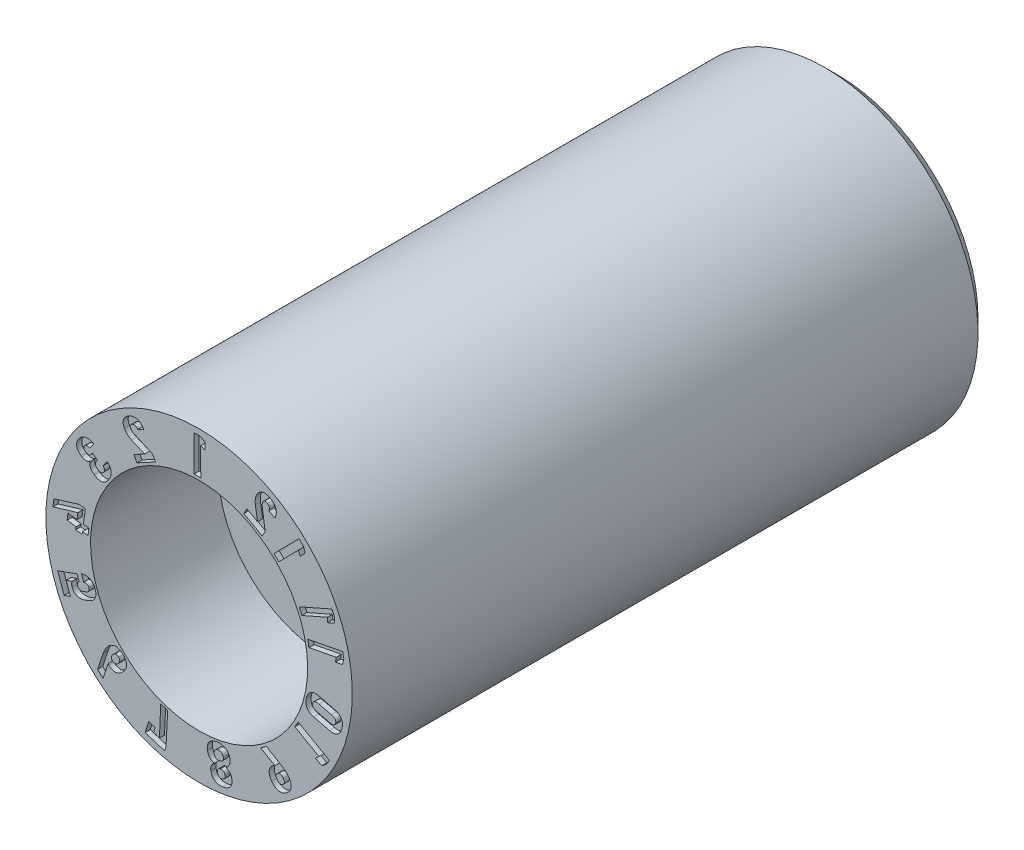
from build123d import *

# Parameters (mm, degrees)
CUT_EXTRUDE1_DEPTH = 0.2


with BuildPart() as part:
    # Sketch1 → Revolve1 (revolve)
    with BuildSketch(Plane(origin=(0, 0, 0), x_dir=(0, 0, -1), z_dir=(1, 0, 0)), mode=Mode.PRIVATE) as revolve1_sk:
        Polygon((25, 3), (25, 5.5), (24.5, 6), (0, 6), (0, 4.25), (5, 4.25), (5, 1.5), (18, 1.5), (18, 3), align=None)
    revolve(revolve1_sk.sketch.rotate(Axis((0, 0, 0), (0, 0, -1)), 180), axis=Axis((0, 0, 0), (0, 0, -1)))

    # Sketch2 → Cut-Extrude1 (cut)
    # profile 1 of 15: a face of its own
    with BuildSketch(Plane.XY):
        Polygon((-0.197789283, 4.361647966), (0.066563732, 4.363172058), (0.060734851, 5.45638428), (0.232188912, 5.392327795), (0.230736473, 5.673574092), (0.020579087, 5.766859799), (-0.20515278, 5.765581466), align=None)
    # profile 2 of 15: a face of its own
    with BuildSketch(Plane.XY):
        with BuildLine():
            Line((-1.818293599, 4.226114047), (-2.540496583, 4.55327584))
            add(Edge.make_bspline(
                [(-2.540496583, 4.55327584), (-2.570849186, 4.567228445), (-2.607531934, 4.587861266), (-2.643392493, 4.620897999), (-2.66313812, 4.641625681), (-2.675061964, 4.658815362), (-2.681524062, 4.670623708)],
                knots=[0, 0, 0, 0, 0.540031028, 0.66553244, 0.783527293, 1, 1, 1, 1], degree=3))
            Line((-2.681524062, 4.670623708), (-2.682483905, 4.672279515))
            add(Edge.make_bspline(
                [(-2.682483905, 4.672279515), (-2.691000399, 4.687155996), (-2.699210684, 4.711252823), (-2.698842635, 4.744176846), (-2.692586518, 4.767175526), (-2.680864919, 4.788954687), (-2.657016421, 4.817386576), (-2.632502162, 4.833373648), (-2.614935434, 4.842989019)],
                knots=[0, 0, 0, 0, 0.246786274, 0.356909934, 0.46944845, 0.586307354, 0.710253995, 1, 1, 1, 1], degree=3))
            add(Edge.make_bspline(
                [(-2.614935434, 4.842989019), (-2.597313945, 4.85241795), (-2.568802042, 4.862517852), (-2.529364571, 4.862700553), (-2.500878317, 4.856309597), (-2.47339714, 4.843926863), (-2.436703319, 4.81861036), (-2.414141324, 4.791924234), (-2.400526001, 4.772308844)],
                knots=[0, 0, 0, 0, 0.240300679, 0.353786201, 0.468512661, 0.587496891, 0.71289196, 1, 1, 1, 1], degree=3))
            Line((-2.400526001, 4.772308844), (-2.400124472, 4.771361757))
            Line((-2.400124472, 4.771361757), (-2.162339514, 4.899762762))
            Line((-2.162339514, 4.899762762), (-2.162741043, 4.900709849))
            add(Edge.make_bspline(
                [(-2.162741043, 4.900709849), (-2.184602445, 4.935428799), (-2.221196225, 4.983520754), (-2.278910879, 5.036863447), (-2.323937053, 5.068901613), (-2.371113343, 5.094233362), (-2.420103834, 5.112587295), (-2.470846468, 5.122937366), (-2.522762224, 5.126556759), (-2.575604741, 5.122918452), (-2.647953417, 5.107258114), (-2.700403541, 5.085897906), (-2.733995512, 5.067458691)],
                knots=[0, 0, 0, 0, 0.185247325, 0.270908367, 0.35379884, 0.433963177, 0.511943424, 0.589014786, 0.666847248, 0.746166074, 0.827198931, 1, 1, 1, 1], degree=3))
            add(Edge.make_bspline(
                [(-2.733995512, 5.067458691), (-2.769634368, 5.048059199), (-2.819604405, 5.015973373), (-2.876537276, 4.964598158), (-2.910766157, 4.924674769), (-2.938201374, 4.882841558), (-2.958403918, 4.839047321), (-2.971663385, 4.793560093), (-2.976863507, 4.746392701), (-2.975338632, 4.698075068), (-2.962100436, 4.630645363), (-2.941815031, 4.581759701), (-2.924660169, 4.550181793)],
                knots=[0, 0, 0, 0, 0.194582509, 0.283014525, 0.366623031, 0.445927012, 0.521986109, 0.596944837, 0.671952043, 0.748457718, 0.827747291, 1, 1, 1, 1], degree=3))
            Line((-2.924660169, 4.550181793), (-2.92425864, 4.549234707))
            add(Edge.make_bspline(
                [(-2.92425864, 4.549234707), (-2.908886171, 4.521411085), (-2.882739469, 4.480982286), (-2.840349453, 4.432515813), (-2.805656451, 4.398035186), (-2.768167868, 4.366461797), (-2.715035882, 4.329496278), (-2.672571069, 4.306223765), (-2.643023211, 4.293564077)],
                knots=[0, 0, 0, 0, 0.24663637, 0.371530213, 0.498650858, 0.625608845, 0.751024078, 1, 1, 1, 1], degree=3))
            Line((-2.643023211, 4.293564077), (-2.133326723, 4.074760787))
            Line((-2.133326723, 4.074760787), (-2.554003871, 3.847419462))
            Line((-2.554003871, 3.847419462), (-2.433287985, 3.623909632))
            Line((-2.433287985, 3.623909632), (-1.705501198, 4.01703613))
            Line((-1.705501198, 4.01703613), (-1.818293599, 4.226114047))
        make_face()
    # profile 3 of 15: a face of its own
    with BuildSketch(Plane.XY):
        with BuildLine():
            Line((-3.602387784, 3.083039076), (-3.758433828, 2.861259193))
            add(Edge.make_bspline(
                [(-3.758433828, 2.861259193), (-3.748419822, 2.851976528), (-3.734779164, 2.837146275), (-3.720584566, 2.815148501), (-3.712343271, 2.798664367), (-3.707009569, 2.781734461), (-3.703533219, 2.764720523), (-3.702578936, 2.747563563), (-3.703624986, 2.730286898), (-3.707248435, 2.713207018), (-3.715443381, 2.690115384), (-3.724594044, 2.673726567), (-3.732029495, 2.663347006)],
                knots=[0, 0, 0, 0, 0.185668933, 0.271849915, 0.355025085, 0.435165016, 0.512269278, 0.590352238, 0.667877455, 0.746757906, 0.826657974, 1, 1, 1, 1], degree=3))
            add(Edge.make_bspline(
                [(-3.732029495, 2.663347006), (-3.744748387, 2.644964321), (-3.766927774, 2.620306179), (-3.804025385, 2.599855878), (-3.832434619, 2.591770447), (-3.862139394, 2.59033721), (-3.904294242, 2.598172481), (-3.933667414, 2.614184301), (-3.952177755, 2.627114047)],
                knots=[0, 0, 0, 0, 0.265738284, 0.383017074, 0.496928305, 0.612242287, 0.731702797, 1, 1, 1, 1], degree=3))
            Line((-3.952177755, 2.627114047), (-3.978885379, 2.645696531))
            add(Edge.make_bspline(
                [(-3.978885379, 2.645696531), (-3.998098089, 2.659463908), (-4.024807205, 2.681161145), (-4.049615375, 2.716775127), (-4.060927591, 2.742705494), (-4.066432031, 2.769009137), (-4.063886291, 2.805254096), (-4.052075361, 2.830574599), (-4.041164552, 2.845546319)],
                knots=[0, 0, 0, 0, 0.300575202, 0.428718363, 0.545675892, 0.65647807, 0.76535517, 1, 1, 1, 1], degree=3))
            Line((-4.041164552, 2.845546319), (-3.973447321, 2.942110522))
            Line((-3.973447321, 2.942110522), (-4.180536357, 3.087679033))
            Line((-4.180536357, 3.087679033), (-4.248253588, 2.991114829))
            add(Edge.make_bspline(
                [(-4.248253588, 2.991114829), (-4.256623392, 2.978356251), (-4.273519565, 2.962758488), (-4.301382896, 2.951229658), (-4.324119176, 2.948536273), (-4.348413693, 2.951155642), (-4.384258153, 2.961641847), (-4.409757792, 2.976563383), (-4.426423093, 2.988197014)],
                knots=[0, 0, 0, 0, 0.22677833, 0.333313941, 0.445234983, 0.564594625, 0.695766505, 1, 1, 1, 1], degree=3))
            Line((-4.426423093, 2.988197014), (-4.445613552, 3.00190584))
            add(Edge.make_bspline(
                [(-4.445613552, 3.00190584), (-4.461191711, 3.013062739), (-4.482773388, 3.031063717), (-4.501989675, 3.061032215), (-4.510478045, 3.083242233), (-4.513410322, 3.106046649), (-4.51020609, 3.137724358), (-4.499075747, 3.159863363), (-4.489429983, 3.173228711)],
                knots=[0, 0, 0, 0, 0.288124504, 0.41192529, 0.528488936, 0.640572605, 0.752466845, 1, 1, 1, 1], degree=3))
            add(Edge.make_bspline(
                [(-4.489429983, 3.173228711), (-4.482824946, 3.182610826), (-4.47134178, 3.195685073), (-4.452365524, 3.208401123), (-4.437372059, 3.216498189), (-4.420836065, 3.221796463), (-4.403482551, 3.225991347), (-4.384892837, 3.226740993), (-4.365536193, 3.226285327), (-4.345341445, 3.223375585), (-4.316510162, 3.216628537), (-4.295258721, 3.208021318), (-4.281005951, 3.201599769)],
                knots=[0, 0, 0, 0, 0.150327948, 0.223514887, 0.297445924, 0.371958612, 0.449582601, 0.529747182, 0.613908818, 0.702218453, 0.795553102, 1, 1, 1, 1], degree=3))
            Line((-4.281005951, 3.201599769), (-4.125668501, 3.422821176))
            add(Edge.make_bspline(
                [(-4.125668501, 3.422821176), (-4.160671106, 3.442797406), (-4.214726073, 3.467958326), (-4.289921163, 3.487213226), (-4.344493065, 3.494145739), (-4.397880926, 3.493985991), (-4.44973917, 3.487595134), (-4.499414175, 3.473469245), (-4.546846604, 3.452966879), (-4.591674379, 3.426546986), (-4.647732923, 3.382744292), (-4.683195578, 3.341933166), (-4.703851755, 3.312213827)],
                knots=[0, 0, 0, 0, 0.185402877, 0.271954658, 0.355808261, 0.437510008, 0.51672484, 0.595164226, 0.673981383, 0.753613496, 0.833638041, 1, 1, 1, 1], degree=3))
            add(Edge.make_bspline(
                [(-4.703851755, 3.312213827), (-4.720542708, 3.288235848), (-4.743205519, 3.251896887), (-4.766447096, 3.201469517), (-4.779391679, 3.165075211), (-4.788296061, 3.12902815), (-4.793555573, 3.093395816), (-4.794670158, 3.058203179), (-4.791569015, 3.023659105), (-4.784971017, 2.989853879), (-4.774390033, 2.957116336), (-4.759859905, 2.925537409), (-4.741663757, 2.895005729), (-4.719101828, 2.866075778), (-4.683560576, 2.827708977), (-4.652078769, 2.802617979), (-4.629793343, 2.786671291)],
                knots=[0, 0, 0, 0, 0.145221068, 0.21203939, 0.275497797, 0.336822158, 0.396212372, 0.454116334, 0.511300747, 0.568162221, 0.624888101, 0.681779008, 0.74052302, 0.801035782, 0.86369242, 1, 1, 1, 1], degree=3))
            Line((-4.629793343, 2.786671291), (-4.595278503, 2.762409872))
            add(Edge.make_bspline(
                [(-4.595278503, 2.762409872), (-4.570307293, 2.745071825), (-4.53033843, 2.723037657), (-4.472476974, 2.708670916), (-4.429300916, 2.704263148), (-4.385954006, 2.707139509), (-4.327635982, 2.720146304), (-4.286804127, 2.740831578), (-4.261153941, 2.757514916)],
                knots=[0, 0, 0, 0, 0.256538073, 0.378140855, 0.499461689, 0.620240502, 0.742003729, 1, 1, 1, 1], degree=3))
            add(Edge.make_bspline(
                [(-4.261153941, 2.757514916), (-4.267756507, 2.742273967), (-4.274899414, 2.718563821), (-4.280034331, 2.686390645), (-4.282001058, 2.662679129), (-4.281102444, 2.639059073), (-4.277721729, 2.615662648), (-4.272429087, 2.592216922), (-4.264612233, 2.569034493), (-4.254562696, 2.54616059), (-4.242205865, 2.523970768), (-4.228087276, 2.50223551), (-4.211524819, 2.481292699), (-4.192991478, 2.460766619), (-4.164606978, 2.433782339), (-4.140802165, 2.415630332), (-4.124340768, 2.403774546)],
                knots=[0, 0, 0, 0, 0.120514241, 0.178963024, 0.236485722, 0.293075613, 0.350257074, 0.408015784, 0.467448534, 0.527698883, 0.589261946, 0.6517676, 0.715782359, 0.78301219, 0.852531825, 1, 1, 1, 1], degree=3))
            Line((-4.124340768, 2.403774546), (-4.089825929, 2.379513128))
            add(Edge.make_bspline(
                [(-4.089825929, 2.379513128), (-4.058900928, 2.35757636), (-4.010446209, 2.32984393), (-3.941973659, 2.306958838), (-3.892460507, 2.29774944), (-3.843513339, 2.295847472), (-3.795487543, 2.30232439), (-3.748439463, 2.315845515), (-3.702745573, 2.337049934), (-3.658621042, 2.36565371), (-3.600551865, 2.414963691), (-3.56291886, 2.460411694), (-3.53978661, 2.493326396)],
                knots=[0, 0, 0, 0, 0.178207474, 0.259966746, 0.33803101, 0.414007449, 0.489004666, 0.564650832, 0.643103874, 0.724692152, 0.81089971, 1, 1, 1, 1], degree=3))
            add(Edge.make_bspline(
                [(-3.53978661, 2.493326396), (-3.516564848, 2.526033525), (-3.486909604, 2.577342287), (-3.459961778, 2.649890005), (-3.447043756, 2.70338819), (-3.440678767, 2.756651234), (-3.442254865, 2.809165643), (-3.450606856, 2.860598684), (-3.466173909, 2.910750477), (-3.489294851, 2.958707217), (-3.530787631, 3.020332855), (-3.572153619, 3.059472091), (-3.602387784, 3.083039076)],
                knots=[0, 0, 0, 0, 0.181513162, 0.266410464, 0.349351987, 0.429979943, 0.508354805, 0.586249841, 0.66506638, 0.74508699, 0.826277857, 1, 1, 1, 1], degree=3))
        make_face()
    # profile 4 of 15: a face of its own
    with BuildSketch(Plane.XY):
        Polygon((-4.69377454, 1.085606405), (-5.68439717, 0.783595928), (-5.724131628, 0.487990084), (-4.746612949, 0.779988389), (-4.780502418, 0.527004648), (-5.131814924, 0.574197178), (-5.166887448, 0.312815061), (-4.815517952, 0.265614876), (-4.830064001, 0.157029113), (-4.578413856, 0.123149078), (-4.563824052, 0.231804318), (-4.350243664, 0.203113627), (-4.31517114, 0.464495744), (-4.528727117, 0.493183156), (-4.453507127, 1.053372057), align=None)
    # profile 5 of 15: a face of its own
    with BuildSketch(Plane.XY):
        with BuildLine():
            Line((-4.607096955, -1.217617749), (-4.51827577, -1.467169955))
            add(Edge.make_bspline(
                [(-4.51827577, -1.467169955), (-4.494689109, -1.460592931), (-4.460693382, -1.456420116), (-4.416873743, -1.46065281), (-4.388272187, -1.469579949), (-4.362841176, -1.483266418), (-4.334063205, -1.509184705), (-4.319061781, -1.534600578), (-4.312754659, -1.553269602)],
                knots=[0, 0, 0, 0, 0.286425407, 0.412421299, 0.532755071, 0.648554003, 0.760968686, 1, 1, 1, 1], degree=3))
            add(Edge.make_bspline(
                [(-4.312754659, -1.553269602), (-4.305579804, -1.572893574), (-4.299449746, -1.603801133), (-4.306280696, -1.643855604), (-4.318395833, -1.67074686), (-4.336852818, -1.69504319), (-4.370910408, -1.725742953), (-4.404185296, -1.740282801), (-4.427112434, -1.749173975)],
                knots=[0, 0, 0, 0, 0.244767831, 0.357262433, 0.468878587, 0.585370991, 0.710838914, 1, 1, 1, 1], degree=3))
            Line((-4.427112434, -1.749173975), (-4.537982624, -1.789149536))
            add(Edge.make_bspline(
                [(-4.537982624, -1.789149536), (-4.561091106, -1.797817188), (-4.595556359, -1.806431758), (-4.640640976, -1.807093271), (-4.669461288, -1.801238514), (-4.694992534, -1.790409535), (-4.724252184, -1.767548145), (-4.738164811, -1.742616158), (-4.744610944, -1.725035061)],
                knots=[0, 0, 0, 0, 0.302892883, 0.431392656, 0.550040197, 0.661203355, 0.768793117, 1, 1, 1, 1], degree=3))
            add(Edge.make_bspline(
                [(-4.744610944, -1.725035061), (-4.750667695, -1.708295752), (-4.75664625, -1.682503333), (-4.755943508, -1.647980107), (-4.751158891, -1.623693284), (-4.742372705, -1.600678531), (-4.725203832, -1.571910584), (-4.706760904, -1.554097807), (-4.692912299, -1.544165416)],
                knots=[0, 0, 0, 0, 0.263348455, 0.385871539, 0.507659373, 0.627206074, 0.748082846, 1, 1, 1, 1], degree=3))
            Line((-4.692912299, -1.544165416), (-4.776675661, -1.311518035))
            Line((-4.776675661, -1.311518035), (-5.53654919, -1.585006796))
            Line((-5.53654919, -1.585006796), (-5.280941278, -2.2949181))
            Line((-5.280941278, -2.2949181), (-5.040936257, -2.20841889))
            Line((-5.040936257, -2.20841889), (-5.206881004, -1.747735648))
            Line((-5.206881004, -1.747735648), (-4.973391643, -1.663648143))
            add(Edge.make_bspline(
                [(-4.973391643, -1.663648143), (-4.979449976, -1.677003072), (-4.985461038, -1.699039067), (-4.988961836, -1.730295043), (-4.989084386, -1.756109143), (-4.987249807, -1.782562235), (-4.982293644, -1.817197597), (-4.975641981, -1.84237532), (-4.969897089, -1.858556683)],
                knots=[0, 0, 0, 0, 0.220311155, 0.341953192, 0.473174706, 0.6088078, 0.74130697, 1, 1, 1, 1], degree=3))
            add(Edge.make_bspline(
                [(-4.969897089, -1.858556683), (-4.958581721, -1.890697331), (-4.936219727, -1.935901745), (-4.894949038, -1.986898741), (-4.86019654, -2.018287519), (-4.821134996, -2.04359536), (-4.77784778, -2.062244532), (-4.730774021, -2.074384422), (-4.680004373, -2.080094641), (-4.626069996, -2.079481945), (-4.54731013, -2.069520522), (-4.488148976, -2.052524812), (-4.448319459, -2.038377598)],
                knots=[0, 0, 0, 0, 0.163572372, 0.239328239, 0.313612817, 0.387362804, 0.461652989, 0.538788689, 0.619799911, 0.706109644, 0.797006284, 1, 1, 1, 1], degree=3))
            Line((-4.448319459, -2.038377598), (-4.337449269, -1.998402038))
            add(Edge.make_bspline(
                [(-4.337449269, -1.998402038), (-4.297444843, -1.984455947), (-4.241320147, -1.958171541), (-4.175239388, -1.912692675), (-4.134539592, -1.874994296), (-4.100554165, -1.833931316), (-4.074147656, -1.789239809), (-4.054609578, -1.741444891), (-4.042923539, -1.690305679), (-4.038683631, -1.63640926), (-4.043106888, -1.558858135), (-4.058987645, -1.500906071), (-4.072323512, -1.462352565)],
                knots=[0, 0, 0, 0, 0.186940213, 0.272022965, 0.353192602, 0.431092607, 0.506534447, 0.581498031, 0.658173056, 0.737158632, 0.819460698, 1, 1, 1, 1], degree=3))
            add(Edge.make_bspline(
                [(-4.072323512, -1.462352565), (-4.084046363, -1.428129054), (-4.108525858, -1.380361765), (-4.150649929, -1.323582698), (-4.187145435, -1.287095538), (-4.22800539, -1.255919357), (-4.272899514, -1.230866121), (-4.321556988, -1.21178423), (-4.373827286, -1.199378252), (-4.429157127, -1.193558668), (-4.50807175, -1.194675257), (-4.567620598, -1.206304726), (-4.607096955, -1.217617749)],
                knots=[0, 0, 0, 0, 0.165262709, 0.244174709, 0.322923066, 0.400784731, 0.478837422, 0.557608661, 0.639405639, 0.724105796, 0.81178613, 1, 1, 1, 1], degree=3))
        make_face()
    # profile 6 of 15: a face of its own
    with BuildSketch(Plane.XY):
        with BuildLine():
            Line((-3.764542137, -3.514787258), (-3.973189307, -4.145807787))
            Line((-3.973189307, -4.145807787), (-3.756859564, -4.350843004))
            Line((-3.756859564, -4.350843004), (-3.563809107, -3.74675713))
            add(Edge.make_bspline(
                [(-3.563809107, -3.74675713), (-3.553912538, -3.760667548), (-3.542386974, -3.773421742), (-3.530054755, -3.785180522)],
                knots=[0.758677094, 0.758677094, 0.758677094, 0.758677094, 1, 1, 1, 1], degree=3))
            add(Edge.make_bspline(
                [(-3.530054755, -3.785180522), (-3.504116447, -3.810114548), (-3.462168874, -3.842372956), (-3.400317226, -3.872136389), (-3.354127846, -3.886167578), (-3.307071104, -3.893270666), (-3.259481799, -3.892038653), (-3.211645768, -3.883894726), (-3.163902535, -3.867946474), (-3.116204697, -3.845175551), (-3.051660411, -3.802910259), (-3.006841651, -3.763437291), (-2.97904452, -3.733339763)],
                knots=[0, 0, 0, 0, 0.171862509, 0.250291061, 0.32656686, 0.401554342, 0.47651707, 0.552895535, 0.632432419, 0.716093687, 0.80458129, 1, 1, 1, 1], degree=3))
            add(Edge.make_bspline(
                [(-2.97904452, -3.733339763), (-2.949407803, -3.70265089), (-2.911219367, -3.654584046), (-2.873337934, -3.584851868), (-2.853668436, -3.533537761), (-2.841710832, -3.48208586), (-2.837873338, -3.430719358), (-2.842197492, -3.379737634), (-2.854674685, -3.329455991), (-2.874821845, -3.280092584), (-2.913306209, -3.213972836), (-2.952234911, -3.169466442), (-2.981510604, -3.141840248)],
                knots=[0, 0, 0, 0, 0.186979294, 0.272364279, 0.353583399, 0.431716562, 0.507485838, 0.58271972, 0.659285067, 0.738013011, 0.8200875, 1, 1, 1, 1], degree=3))
            add(Edge.make_bspline(
                [(-2.981510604, -3.141840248), (-3.010547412, -3.114279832), (-3.056750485, -3.077770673), (-3.124443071, -3.042537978), (-3.174663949, -3.024845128), (-3.225347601, -3.015259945), (-3.276114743, -3.013428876), (-3.32684216, -3.019567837), (-3.377392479, -3.033346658), (-3.427127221, -3.055386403), (-3.49432846, -3.096164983), (-3.5394467, -3.137030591), (-3.568153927, -3.166914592)],
                knots=[0, 0, 0, 0, 0.180127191, 0.262705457, 0.342107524, 0.418644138, 0.493745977, 0.569602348, 0.647518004, 0.728441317, 0.813380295, 1, 1, 1, 1], degree=3))
            add(Edge.make_bspline(
                [(-3.568153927, -3.166914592), (-3.586760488, -3.186400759), (-3.612178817, -3.217109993), (-3.643344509, -3.261133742), (-3.690178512, -3.334663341), (-3.721798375, -3.40139848), (-3.743486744, -3.456589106)],
                knots=[0, 0, 0, 0, 0.230619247, 0.351394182, 0.476038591, 1, 1, 1, 1], degree=3))
            add(Edge.make_bspline(
                [(-3.743486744, -3.456589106), (-3.74731118, -3.46628495), (-3.75533677, -3.485330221), (-3.761194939, -3.505146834), (-3.764542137, -3.514787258)],
                knots=[0, 0, 0, 0, 0.505360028, 1, 1, 1, 1], degree=3))
        make_face()
        with BuildLine():
            Line((-3.157954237, -3.539554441), (-3.158765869, -3.540452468))
            add(Edge.make_bspline(
                [(-3.158765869, -3.540452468), (-3.176638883, -3.558829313), (-3.204363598, -3.583698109), (-3.246842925, -3.604345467), (-3.277068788, -3.611799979), (-3.306991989, -3.612257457), (-3.346933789, -3.602970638), (-3.37307914, -3.58481069), (-3.388363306, -3.570337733)],
                knots=[0, 0, 0, 0, 0.294328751, 0.419071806, 0.536316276, 0.647265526, 0.758044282, 1, 1, 1, 1], degree=3))
            add(Edge.make_bspline(
                [(-3.388363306, -3.570337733), (-3.404108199, -3.556308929), (-3.422291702, -3.53070194), (-3.434012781, -3.491521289), (-3.434297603, -3.461407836), (-3.427841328, -3.430715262), (-3.409420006, -3.387201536), (-3.386427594, -3.357942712), (-3.368895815, -3.339389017)],
                knots=[0, 0, 0, 0, 0.240144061, 0.350681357, 0.462748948, 0.580659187, 0.707140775, 1, 1, 1, 1], degree=3))
            add(Edge.make_bspline(
                [(-3.368895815, -3.339389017), (-3.353025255, -3.322585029), (-3.327989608, -3.301635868), (-3.289870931, -3.285036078), (-3.262011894, -3.279969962), (-3.234215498, -3.28202118), (-3.196054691, -3.292782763), (-3.171434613, -3.311909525), (-3.156187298, -3.325783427)],
                knots=[0, 0, 0, 0, 0.277582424, 0.398175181, 0.512354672, 0.625221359, 0.741294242, 1, 1, 1, 1], degree=3))
            add(Edge.make_bspline(
                [(-3.156187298, -3.325783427), (-3.140901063, -3.340160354), (-3.121101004, -3.364223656), (-3.10753132, -3.40179025), (-3.10477251, -3.429752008), (-3.108326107, -3.458026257), (-3.12243896, -3.497446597), (-3.142679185, -3.523337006), (-3.157954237, -3.539554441)],
                knots=[0, 0, 0, 0, 0.260003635, 0.375027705, 0.487763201, 0.603252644, 0.723685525, 1, 1, 1, 1], degree=3))
        make_face(mode=Mode.SUBTRACT)
    # profile 7 of 15: a face of its own
    with BuildSketch(Plane.XY):
        Polygon((-1.295226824, -5.433053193), (-1.227797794, -4.170593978), (-1.500745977, -4.085051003), (-1.553577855, -5.269311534), (-1.782967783, -5.197139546), (-1.71995233, -4.99580703), (-1.971834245, -4.916973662), (-2.11102816, -5.360906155), (-1.347689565, -5.600343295), align=None)
    # profile 8 of 15: a face of its own
    with BuildSketch(Plane.XY):
        with BuildLine():
            Line((0.325136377, -4.725408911), (0.328907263, -4.748223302))
            add(Edge.make_bspline(
                [(0.328907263, -4.748223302), (0.334365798, -4.782241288), (0.349955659, -4.832237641), (0.384694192, -4.892895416), (0.417183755, -4.93510184), (0.455059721, -4.97277418), (0.511366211, -5.015529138), (0.559969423, -5.037223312), (0.593478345, -5.047470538)],
                knots=[0, 0, 0, 0, 0.245718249, 0.369513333, 0.497226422, 0.624713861, 0.74971991, 1, 1, 1, 1], degree=3))
            add(Edge.make_bspline(
                [(0.593478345, -5.047470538), (0.569198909, -5.064943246), (0.535516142, -5.095219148), (0.500680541, -5.143899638), (0.479537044, -5.183094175), (0.464333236, -5.224256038), (0.451735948, -5.279896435), (0.452639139, -5.32264326), (0.457022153, -5.350234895)],
                knots=[0, 0, 0, 0, 0.257021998, 0.384551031, 0.51217146, 0.63812076, 0.76004896, 1, 1, 1, 1], degree=3))
            Line((0.457022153, -5.350234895), (0.462910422, -5.386485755))
            add(Edge.make_bspline(
                [(0.462910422, -5.386485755), (0.46865663, -5.420749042), (0.482465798, -5.470934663), (0.515050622, -5.530550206), (0.544225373, -5.570298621), (0.579326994, -5.604306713), (0.618470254, -5.633868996), (0.662705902, -5.656971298), (0.71070847, -5.674990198), (0.762480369, -5.686783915), (0.83743033, -5.69389648), (0.895126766, -5.689874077), (0.93381258, -5.683369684)],
                knots=[0, 0, 0, 0, 0.166755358, 0.246297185, 0.32438274, 0.402008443, 0.479602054, 0.55855855, 0.640168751, 0.724632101, 0.812104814, 1, 1, 1, 1], degree=3))
            add(Edge.make_bspline(
                [(0.93381258, -5.683369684), (0.972381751, -5.67667099), (1.028688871, -5.663022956), (1.097201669, -5.631673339), (1.142530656, -5.603915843), (1.182236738, -5.571397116), (1.21683184, -5.535558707), (1.244571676, -5.495201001), (1.266605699, -5.451593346), (1.281758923, -5.404753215), (1.293740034, -5.337870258), (1.290833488, -5.285968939), (1.285133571, -5.25163322)],
                knots=[0, 0, 0, 0, 0.187908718, 0.275416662, 0.360083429, 0.441840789, 0.520724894, 0.597915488, 0.675567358, 0.754033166, 0.832947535, 1, 1, 1, 1], degree=3))
            Line((1.285133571, -5.25163322), (1.279245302, -5.21538236))
            add(Edge.make_bspline(
                [(1.279245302, -5.21538236), (1.274671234, -5.187306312), (1.261360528, -5.146180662), (1.231257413, -5.096976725), (1.202893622, -5.063229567), (1.170302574, -5.032782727), (1.121160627, -4.998349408), (1.079460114, -4.980611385), (1.050489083, -4.972411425)],
                knots=[0, 0, 0, 0, 0.242452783, 0.36386828, 0.489952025, 0.617354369, 0.743250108, 1, 1, 1, 1], degree=3))
            add(Edge.make_bspline(
                [(1.050489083, -4.972411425), (1.079647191, -4.952118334), (1.118403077, -4.915207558), (1.159048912, -4.856850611), (1.182939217, -4.809026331), (1.200967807, -4.758904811), (1.2146699, -4.690279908), (1.213882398, -4.637881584), (1.208120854, -4.603808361)],
                knots=[0, 0, 0, 0, 0.252158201, 0.376883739, 0.504107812, 0.63129592, 0.754621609, 1, 1, 1, 1], degree=3))
            Line((1.208120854, -4.603808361), (1.204349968, -4.58099397))
            add(Edge.make_bspline(
                [(1.204349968, -4.58099397), (1.19807011, -4.544626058), (1.183740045, -4.491346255), (1.149035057, -4.428167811), (1.117860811, -4.386409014), (1.080966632, -4.349871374), (1.038800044, -4.319305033), (0.991719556, -4.294667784), (0.940132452, -4.27631133), (0.884744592, -4.263930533), (0.80453475, -4.256434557), (0.74284993, -4.260794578), (0.701457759, -4.267790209)],
                knots=[0, 0, 0, 0, 0.16647075, 0.245115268, 0.323050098, 0.400163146, 0.477804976, 0.556487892, 0.63841142, 0.723457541, 0.811169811, 1, 1, 1, 1], degree=3))
            add(Edge.make_bspline(
                [(0.701457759, -4.267790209), (0.660116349, -4.274758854), (0.599931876, -4.289565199), (0.526648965, -4.323058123), (0.477950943, -4.352168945), (0.435113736, -4.386113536), (0.398334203, -4.424274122), (0.368469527, -4.466877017), (0.344971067, -4.513249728), (0.328465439, -4.562779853), (0.316386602, -4.633881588), (0.319146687, -4.688861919), (0.325136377, -4.725408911)],
                knots=[0, 0, 0, 0, 0.188911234, 0.27665744, 0.361678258, 0.443562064, 0.521838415, 0.599287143, 0.67674178, 0.75495613, 0.833257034, 1, 1, 1, 1], degree=3))
        make_face()
        with BuildLine():
            Line((0.949184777, -4.661823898), (0.95157254, -4.675169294))
            add(Edge.make_bspline(
                [(0.95157254, -4.675169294), (0.954069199, -4.689979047), (0.955000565, -4.712364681), (0.949984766, -4.741256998), (0.943197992, -4.761450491), (0.933266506, -4.780076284), (0.92142134, -4.797619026), (0.906435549, -4.813173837), (0.889176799, -4.827082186), (0.869671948, -4.839126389), (0.839918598, -4.85224738), (0.815782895, -4.858636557), (0.798960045, -4.861146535)],
                knots=[0, 0, 0, 0, 0.166565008, 0.245859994, 0.324124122, 0.401702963, 0.479331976, 0.558127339, 0.640220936, 0.724652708, 0.811551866, 1, 1, 1, 1], degree=3))
            add(Edge.make_bspline(
                [(0.798960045, -4.861146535), (0.782179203, -4.863708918), (0.757233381, -4.866179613), (0.724787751, -4.862832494), (0.702385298, -4.85790535), (0.68152969, -4.850091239), (0.662644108, -4.839678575), (0.645248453, -4.827469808), (0.630321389, -4.812341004), (0.617279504, -4.795435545), (0.60323051, -4.769524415), (0.597314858, -4.747861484), (0.594744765, -4.73304167)],
                knots=[0, 0, 0, 0, 0.188246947, 0.274866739, 0.359835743, 0.44132157, 0.520220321, 0.597868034, 0.675487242, 0.75432286, 0.833354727, 1, 1, 1, 1], degree=3))
            Line((0.594744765, -4.73304167), (0.592354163, -4.71879406))
            add(Edge.make_bspline(
                [(0.592354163, -4.71879406), (0.589653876, -4.702843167), (0.588529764, -4.678816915), (0.593027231, -4.647669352), (0.599807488, -4.625955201), (0.609180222, -4.605700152), (0.6210272, -4.586925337), (0.636084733, -4.570466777), (0.653241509, -4.555549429), (0.672994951, -4.543060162), (0.702141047, -4.528491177), (0.726443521, -4.522494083), (0.742940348, -4.51965073)],
                knots=[0, 0, 0, 0, 0.17278034, 0.255068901, 0.335187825, 0.415003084, 0.493110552, 0.571409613, 0.652579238, 0.735418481, 0.820528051, 1, 1, 1, 1], degree=3))
            add(Edge.make_bspline(
                [(0.742940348, -4.51965073), (0.759488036, -4.516730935), (0.784423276, -4.515198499), (0.816732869, -4.519529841), (0.83928834, -4.525478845), (0.860408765, -4.534165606), (0.879945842, -4.545193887), (0.897192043, -4.55950511), (0.912600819, -4.575823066), (0.925895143, -4.594417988), (0.940241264, -4.622544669), (0.946404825, -4.645878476), (0.949184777, -4.661823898)],
                knots=[0, 0, 0, 0, 0.179082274, 0.263835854, 0.346472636, 0.426936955, 0.506638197, 0.584521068, 0.664787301, 0.745258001, 0.827239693, 1, 1, 1, 1], degree=3))
        make_face(mode=Mode.SUBTRACT)
        with BuildLine():
            Line((1.01616837, -5.247697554), (1.018285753, -5.261134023))
            add(Edge.make_bspline(
                [(1.018285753, -5.261134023), (1.020590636, -5.274890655), (1.021847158, -5.29554196), (1.017868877, -5.322221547), (1.012823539, -5.340885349), (1.005052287, -5.358200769), (0.995217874, -5.374135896), (0.982824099, -5.388277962), (0.968442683, -5.400869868), (0.952202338, -5.412001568), (0.926998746, -5.423261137), (0.90690234, -5.429641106), (0.892600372, -5.431418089)],
                knots=[0, 0, 0, 0, 0.175700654, 0.257572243, 0.338547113, 0.418148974, 0.495516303, 0.573289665, 0.653732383, 0.735586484, 0.819887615, 1, 1, 1, 1], degree=3))
            add(Edge.make_bspline(
                [(0.892600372, -5.431418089), (0.878467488, -5.433186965), (0.857307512, -5.435444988), (0.829968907, -5.431474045), (0.810835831, -5.426954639), (0.792974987, -5.419756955), (0.776835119, -5.409793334), (0.762223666, -5.397824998), (0.749222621, -5.383691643), (0.738386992, -5.367426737), (0.726569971, -5.342917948), (0.720793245, -5.322955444), (0.718627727, -5.309082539)],
                knots=[0, 0, 0, 0, 0.179176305, 0.26272206, 0.344581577, 0.424728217, 0.502426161, 0.581002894, 0.660377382, 0.741777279, 0.824574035, 1, 1, 1, 1], degree=3))
            Line((0.718627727, -5.309082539), (0.716237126, -5.294834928))
            add(Edge.make_bspline(
                [(0.716237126, -5.294834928), (0.713841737, -5.280383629), (0.712697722, -5.258749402), (0.715628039, -5.230518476), (0.720999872, -5.210836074), (0.728419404, -5.192405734), (0.738478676, -5.175576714), (0.750433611, -5.160289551), (0.764916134, -5.146996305), (0.781169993, -5.13550797), (0.805781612, -5.122584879), (0.826400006, -5.117289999), (0.840448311, -5.114811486)],
                knots=[0, 0, 0, 0, 0.178388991, 0.262964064, 0.344995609, 0.426393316, 0.504518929, 0.583338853, 0.662244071, 0.743343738, 0.825530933, 1, 1, 1, 1], degree=3))
            add(Edge.make_bspline(
                [(0.840448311, -5.114811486), (0.854595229, -5.112920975), (0.875918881, -5.110856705), (0.903378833, -5.115471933), (0.922557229, -5.121005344), (0.940426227, -5.129196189), (0.956790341, -5.139802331), (0.971502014, -5.152812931), (0.984445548, -5.168146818), (0.995680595, -5.185390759), (1.008145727, -5.211497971), (1.013767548, -5.232921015), (1.01616837, -5.247697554)],
                knots=[0, 0, 0, 0, 0.173582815, 0.255391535, 0.33549223, 0.414428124, 0.492215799, 0.570545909, 0.651074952, 0.734215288, 0.81882278, 1, 1, 1, 1], degree=3))
        make_face(mode=Mode.SUBTRACT)
    # profile 9 of 15: a face of its own
    with BuildSketch(Plane.XY):
        with BuildLine():
            Line((2.843421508, -4.530222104), (2.844072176, -4.531018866))
            add(Edge.make_bspline(
                [(2.844072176, -4.531018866), (2.869278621, -4.564844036), (2.909777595, -4.61180553), (2.972410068, -4.661723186), (3.019669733, -4.690615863), (3.068579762, -4.711513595), (3.118829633, -4.724180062), (3.170024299, -4.729203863), (3.222044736, -4.72564096), (3.274368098, -4.714399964), (3.346409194, -4.687500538), (3.397304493, -4.656968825), (3.429757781, -4.6327058)],
                knots=[0, 0, 0, 0, 0.187452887, 0.273103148, 0.354468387, 0.432526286, 0.508156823, 0.583550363, 0.659808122, 0.738584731, 0.820197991, 1, 1, 1, 1], degree=3))
            add(Edge.make_bspline(
                [(3.429757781, -4.6327058), (3.462213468, -4.608783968), (3.506482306, -4.569422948), (3.552981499, -4.508322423), (3.578911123, -4.461280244), (3.597119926, -4.412214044), (3.607164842, -4.361462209), (3.609617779, -4.309439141), (3.603777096, -4.256128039), (3.590006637, -4.202020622), (3.56032717, -4.126863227), (3.527525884, -4.073687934), (3.502116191, -4.039504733)],
                knots=[0, 0, 0, 0, 0.17825688, 0.259594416, 0.338119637, 0.414699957, 0.489865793, 0.565781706, 0.64389787, 0.725894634, 0.811718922, 1, 1, 1, 1], degree=3))
            add(Edge.make_bspline(
                [(3.502116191, -4.039504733), (3.48722343, -4.019213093), (3.462574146, -3.990627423), (3.425758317, -3.954872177), (3.394631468, -3.928047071), (3.360893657, -3.901279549), (3.311278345, -3.864500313), (3.271636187, -3.838387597), (3.244584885, -3.820728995)],
                knots=[0, 0, 0, 0, 0.21694703, 0.333215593, 0.453749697, 0.580299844, 0.714145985, 1, 1, 1, 1], degree=3))
            add(Edge.make_bspline(
                [(3.244584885, -3.820728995), (3.236631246, -3.815390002), (3.220424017, -3.805367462), (3.204396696, -3.795030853), (3.195862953, -3.790841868)],
                knots=[0, 0, 0, 0, 0.502405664, 1, 1, 1, 1], degree=3))
            Line((3.195862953, -3.790841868), (2.637033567, -3.455949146))
            Line((2.637033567, -3.455949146), (2.41202314, -3.622027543))
            Line((2.41202314, -3.622027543), (2.968833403, -3.942881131))
            add(Edge.make_bspline(
                [(2.968833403, -3.942881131), (2.967626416, -3.943292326), (2.957449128, -3.946865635), (2.92853925, -3.959729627), (2.902768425, -3.975844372), (2.886040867, -3.988176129)],
                knots=[0.564365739, 0.564365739, 0.564365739, 0.564365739, 0.581964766, 0.713240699, 1, 1, 1, 1], degree=3))
            add(Edge.make_bspline(
                [(2.886040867, -3.988176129), (2.858894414, -4.008063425), (2.822193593, -4.042224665), (2.785228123, -4.096548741), (2.764903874, -4.139745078), (2.750915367, -4.185197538), (2.74356203, -4.232464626), (2.743630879, -4.2812965), (2.750034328, -4.331270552), (2.76347488, -4.381804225), (2.790687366, -4.45069629), (2.820546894, -4.499207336), (2.843421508, -4.530222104)],
                knots=[0, 0, 0, 0, 0.165212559, 0.243295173, 0.321098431, 0.398558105, 0.475899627, 0.554875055, 0.637363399, 0.722438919, 0.810762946, 1, 1, 1, 1], degree=3))
        make_face()
        with BuildLine():
            Line((3.296424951, -4.205845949), (3.296991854, -4.206915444))
            add(Edge.make_bspline(
                [(3.296991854, -4.206915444), (3.311295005, -4.225707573), (3.328115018, -4.255567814), (3.339167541, -4.297978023), (3.339752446, -4.327494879), (3.334028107, -4.355792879), (3.316228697, -4.391846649), (3.294426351, -4.414056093), (3.277386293, -4.426231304)],
                knots=[0, 0, 0, 0, 0.283319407, 0.405630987, 0.522186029, 0.634485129, 0.748744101, 1, 1, 1, 1], degree=3))
            add(Edge.make_bspline(
                [(3.277386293, -4.426231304), (3.26042015, -4.438540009), (3.2328653, -4.454119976), (3.192724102, -4.459459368), (3.163946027, -4.456788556), (3.135884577, -4.447094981), (3.098405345, -4.424039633), (3.074745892, -4.398845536), (3.061035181, -4.379481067)],
                knots=[0, 0, 0, 0, 0.252248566, 0.365947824, 0.478303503, 0.594066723, 0.716780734, 1, 1, 1, 1], degree=3))
            Line((3.061035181, -4.379481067), (3.060384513, -4.378684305))
            add(Edge.make_bspline(
                [(3.060384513, -4.378684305), (3.046008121, -4.359030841), (3.027378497, -4.328594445), (3.016296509, -4.284777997), (3.015066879, -4.254608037), (3.020439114, -4.225810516), (3.037405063, -4.188833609), (3.059913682, -4.166689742), (3.076799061, -4.154209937)],
                knots=[0, 0, 0, 0, 0.287505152, 0.411241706, 0.527095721, 0.639456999, 0.752084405, 1, 1, 1, 1], degree=3))
            add(Edge.make_bspline(
                [(3.076799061, -4.154209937), (3.093403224, -4.141427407), (3.121315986, -4.127149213), (3.1616214, -4.121980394), (3.190860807, -4.12579796), (3.219624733, -4.13570442), (3.257784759, -4.160178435), (3.282123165, -4.185923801), (3.296424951, -4.205845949)],
                knots=[0, 0, 0, 0, 0.246066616, 0.358457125, 0.471834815, 0.589083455, 0.712499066, 1, 1, 1, 1], degree=3))
        make_face(mode=Mode.SUBTRACT)
    # profile 10 of 15: a face of its own
    with BuildSketch(Plane.XY):
        Polygon((3.879111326, -2.003586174), (3.748785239, -2.232844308), (4.697677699, -2.771352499), (4.557304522, -2.887998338), (4.801368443, -3.026434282), (4.986802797, -2.891208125), (5.098111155, -2.695224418), align=None)
    # profile 11 of 15: a face of its own
    with BuildSketch(Plane.XY):
        with BuildLine():
            Line((4.489173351, -1.531152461), (5.107834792, -1.682770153))
            add(Edge.make_bspline(
                [(5.107834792, -1.682770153), (5.13680349, -1.689794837), (5.179932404, -1.697435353), (5.236831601, -1.699589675), (5.276735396, -1.697615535), (5.314906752, -1.691265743), (5.351299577, -1.681132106), (5.385935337, -1.666963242), (5.418749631, -1.649006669), (5.449474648, -1.627242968), (5.477641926, -1.601578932), (5.503521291, -1.572362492), (5.526761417, -1.539256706), (5.547357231, -1.502376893), (5.572655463, -1.446885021), (5.586446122, -1.401836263), (5.594016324, -1.370589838)],
                knots=[0, 0, 0, 0, 0.13593331, 0.198749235, 0.259181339, 0.317692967, 0.374726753, 0.430999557, 0.487858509, 0.544847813, 0.602170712, 0.661142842, 0.72237782, 0.786127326, 0.853396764, 1, 1, 1, 1], degree=3))
            add(Edge.make_bspline(
                [(5.594016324, -1.370589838), (5.601475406, -1.339266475), (5.610372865, -1.292877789), (5.613763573, -1.231812), (5.612790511, -1.18951551), (5.607308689, -1.149377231), (5.598241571, -1.111390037), (5.584994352, -1.075682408), (5.568197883, -1.042234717), (5.547292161, -1.011503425), (5.523178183, -0.983075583), (5.495777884, -0.957045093), (5.464433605, -0.934390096), (5.430350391, -0.913434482), (5.378402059, -0.889601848), (5.336645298, -0.876046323), (5.30760513, -0.868867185)],
                knots=[0, 0, 0, 0, 0.146813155, 0.214283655, 0.278278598, 0.339210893, 0.398461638, 0.455806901, 0.512306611, 0.568519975, 0.624668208, 0.681849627, 0.740176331, 0.800514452, 0.863812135, 1, 1, 1, 1], degree=3))
            Line((5.30760513, -0.868867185), (4.68894369, -0.717249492))
            add(Edge.make_bspline(
                [(4.68894369, -0.717249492), (4.65997505, -0.710224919), (4.616845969, -0.702584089), (4.559947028, -0.700430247), (4.520042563, -0.702403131), (4.481873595, -0.708757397), (4.445472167, -0.718874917), (4.410941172, -0.73307299), (4.378072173, -0.750757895), (4.347348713, -0.772566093), (4.319220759, -0.798399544), (4.293250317, -0.827649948), (4.270018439, -0.860764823), (4.249423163, -0.89764286), (4.22411676, -0.953113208), (4.210414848, -0.998165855), (4.202509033, -1.029298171)],
                knots=[0, 0, 0, 0, 0.135938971, 0.198757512, 0.259192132, 0.317706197, 0.374742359, 0.431017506, 0.487519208, 0.544510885, 0.602242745, 0.661217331, 0.722454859, 0.78620702, 0.85347926, 1, 1, 1, 1], degree=3))
            add(Edge.make_bspline(
                [(4.202509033, -1.029298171), (4.194701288, -1.06061641), (4.186632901, -1.107121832), (4.182849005, -1.16817378), (4.18451001, -1.210548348), (4.189887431, -1.250709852), (4.199154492, -1.288736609), (4.212865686, -1.324375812), (4.230194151, -1.357859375), (4.251024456, -1.388960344), (4.275161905, -1.417550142), (4.302881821, -1.443051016), (4.333705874, -1.466217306), (4.367722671, -1.486777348), (4.418925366, -1.511036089), (4.460450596, -1.524000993), (4.489173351, -1.531152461)],
                knots=[0, 0, 0, 0, 0.147113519, 0.214654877, 0.278552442, 0.340153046, 0.399140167, 0.456578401, 0.513844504, 0.570705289, 0.62691249, 0.684037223, 0.742066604, 0.802468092, 0.864949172, 1, 1, 1, 1], degree=3))
        make_face()
        with BuildLine():
            Line((4.691626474, -0.989737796), (5.179107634, -1.109152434))
            add(Edge.make_bspline(
                [(5.179107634, -1.109152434), (5.208610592, -1.116001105), (5.249469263, -1.130374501), (5.296577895, -1.158099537), (5.318927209, -1.17799783), (5.332508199, -1.195614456), (5.340897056, -1.209265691), (5.346635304, -1.224013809), (5.350784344, -1.239566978), (5.352594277, -1.256042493), (5.353376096, -1.279833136), (5.349682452, -1.297887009), (5.347035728, -1.310001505)],
                knots=[0, 0, 0, 0, 0.304539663, 0.43204438, 0.547815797, 0.602595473, 0.655419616, 0.708330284, 0.761154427, 0.816869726, 0.87465657, 1, 1, 1, 1], degree=3))
            add(Edge.make_bspline(
                [(5.347035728, -1.310001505), (5.34377236, -1.322028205), (5.338666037, -1.33974242), (5.327149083, -1.360495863), (5.318020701, -1.374301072), (5.306890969, -1.385930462), (5.294829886, -1.396280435), (5.281262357, -1.404780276), (5.260997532, -1.414053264), (5.231948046, -1.420932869), (5.177409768, -1.425482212), (5.134522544, -1.416784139), (5.105152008, -1.410281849)],
                knots=[0, 0, 0, 0, 0.125853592, 0.183219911, 0.23811971, 0.291696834, 0.344422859, 0.39754604, 0.452044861, 0.567796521, 0.69537499, 1, 1, 1, 1], degree=3))
            Line((5.105152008, -1.410281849), (4.617670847, -1.290867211))
            add(Edge.make_bspline(
                [(4.617670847, -1.290867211), (4.588377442, -1.283567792), (4.546989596, -1.270249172), (4.500312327, -1.24190629), (4.478055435, -1.222081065), (4.464510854, -1.204541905), (4.456143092, -1.190802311), (4.450148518, -1.176020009), (4.445716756, -1.160398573), (4.44384491, -1.143885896), (4.443757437, -1.120117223), (4.446426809, -1.102007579), (4.44948963, -1.089886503)],
                knots=[0, 0, 0, 0, 0.304458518, 0.431969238, 0.546760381, 0.601513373, 0.654311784, 0.70792616, 0.761369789, 0.817057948, 0.874363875, 1, 1, 1, 1], degree=3))
            add(Edge.make_bspline(
                [(4.44948963, -1.089886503), (4.452475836, -1.077760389), (4.458226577, -1.060311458), (4.469611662, -1.039517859), (4.478759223, -1.025715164), (4.489898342, -1.014107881), (4.501941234, -1.003636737), (4.515771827, -0.99546231), (4.53594769, -0.986117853), (4.564835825, -0.978928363), (4.619345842, -0.975223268), (4.662225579, -0.982734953), (4.691626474, -0.989737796)],
                knots=[0, 0, 0, 0, 0.125813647, 0.183205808, 0.238130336, 0.291731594, 0.344481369, 0.398116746, 0.452640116, 0.567734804, 0.694864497, 1, 1, 1, 1], degree=3))
        make_face(mode=Mode.SUBTRACT)
    # profile 12 of 15: a face of its own
    with BuildSketch(Plane.XY):
        Polygon((4.252200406, 0.988283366), (4.301984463, 0.729306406), (5.371602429, 0.934775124), (5.340352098, 0.755350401), (5.615230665, 0.808382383), (5.668250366, 1.031147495), (5.625848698, 1.252226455), align=None)
    # profile 13 of 15: a face of its own
    with BuildSketch(Plane.XY):
        Polygon((3.920838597, 1.920086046), (4.02775873, 1.678241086), (5.026401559, 2.119889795), (5.036444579, 1.937784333), (5.293133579, 2.051248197), (5.295033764, 2.280760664), (5.203688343, 2.48717586), align=None)
    # profile 14 of 15: a face of its own
    with BuildSketch(Plane.XY):
        Polygon((2.935290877, 3.232527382), (3.123304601, 3.047355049), (3.887554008, 3.823774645), (3.963949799, 3.658414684), (4.160341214, 3.858030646), (4.077421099, 4.07207539), (3.916972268, 4.230031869), align=None)
    # profile 15 of 15: a face of its own
    with BuildSketch(Plane.XY):
        with BuildLine():
            Line((2.586791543, 3.804208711), (2.475535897, 4.586787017))
            add(Edge.make_bspline(
                [(2.475535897, 4.586787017), (2.470260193, 4.619883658), (2.468899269, 4.661735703), (2.47702888, 4.709744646), (2.484346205, 4.737357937), (2.492183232, 4.756700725), (2.498690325, 4.768496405)],
                knots=[0, 0, 0, 0, 0.54047242, 0.665265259, 0.78337336, 1, 1, 1, 1], degree=3))
            Line((2.498690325, 4.768496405), (2.499603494, 4.76973201))
            add(Edge.make_bspline(
                [(2.499603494, 4.76973201), (2.507745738, 4.784814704), (2.523534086, 4.804864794), (2.551420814, 4.822408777), (2.574109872, 4.829457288), (2.598670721, 4.831019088), (2.635336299, 4.826572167), (2.661653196, 4.813710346), (2.679260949, 4.804683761)],
                knots=[0, 0, 0, 0, 0.247785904, 0.358948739, 0.470787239, 0.58680009, 0.711754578, 1, 1, 1, 1], degree=3))
            add(Edge.make_bspline(
                [(2.679260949, 4.804683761), (2.6969229, 4.795071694), (2.72041529, 4.7762138), (2.742101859, 4.743298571), (2.751514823, 4.715751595), (2.756080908, 4.685934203), (2.754022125, 4.641263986), (2.743312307, 4.607949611), (2.734017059, 4.585949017)],
                knots=[0, 0, 0, 0, 0.240719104, 0.353528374, 0.467709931, 0.586635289, 0.713025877, 1, 1, 1, 1], degree=3))
            Line((2.734017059, 4.585949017), (2.733589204, 4.585013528))
            Line((2.733589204, 4.585013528), (2.969159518, 4.453605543))
            Line((2.969159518, 4.453605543), (2.969587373, 4.454541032))
            add(Edge.make_bspline(
                [(2.969587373, 4.454541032), (2.987030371, 4.491742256), (3.008412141, 4.548416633), (3.022231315, 4.625778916), (3.025068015, 4.680760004), (3.020916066, 4.733902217), (3.010327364, 4.784879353), (2.991787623, 4.833091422), (2.96705062, 4.878597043), (2.935717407, 4.921112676), (2.883966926, 4.973622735), (2.837816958, 5.006132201), (2.804516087, 5.024708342)],
                knots=[0, 0, 0, 0, 0.18612394, 0.272066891, 0.354664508, 0.434532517, 0.512656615, 0.589368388, 0.667372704, 0.746382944, 0.827501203, 1, 1, 1, 1], degree=3))
            add(Edge.make_bspline(
                [(2.804516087, 5.024708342), (2.769270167, 5.044680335), (2.715381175, 5.069209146), (2.641743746, 5.089550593), (2.589877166, 5.097104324), (2.540010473, 5.097731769), (2.492264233, 5.091629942), (2.447086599, 5.077722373), (2.404304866, 5.057508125), (2.364585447, 5.030057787), (2.314662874, 4.983214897), (2.28484257, 4.93958243), (2.267213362, 4.908473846)],
                knots=[0, 0, 0, 0, 0.194709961, 0.282992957, 0.366388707, 0.445897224, 0.522009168, 0.596736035, 0.672147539, 0.748567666, 0.827810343, 1, 1, 1, 1], degree=3))
            Line((2.267213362, 4.908473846), (2.266785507, 4.907538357))
            add(Edge.make_bspline(
                [(2.266785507, 4.907538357), (2.251147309, 4.879896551), (2.231686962, 4.836042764), (2.213425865, 4.774511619), (2.203152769, 4.726748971), (2.196850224, 4.678181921), (2.193831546, 4.61359916), (2.197219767, 4.565400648), (2.202069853, 4.533743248)],
                knots=[0, 0, 0, 0, 0.246607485, 0.371179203, 0.498175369, 0.625814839, 0.751251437, 1, 1, 1, 1], degree=3))
            Line((2.202069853, 4.533743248), (2.290472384, 3.988286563))
            Line((2.290472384, 3.988286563), (1.874107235, 4.220568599))
            Line((1.874107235, 4.220568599), (1.750630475, 3.999295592))
            Line((1.750630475, 3.999295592), (2.471246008, 3.597233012))
            Line((2.471246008, 3.597233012), (2.586791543, 3.804208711))
        make_face()
    extrude(amount=-CUT_EXTRUDE1_DEPTH, mode=Mode.SUBTRACT)


solid = part.part
